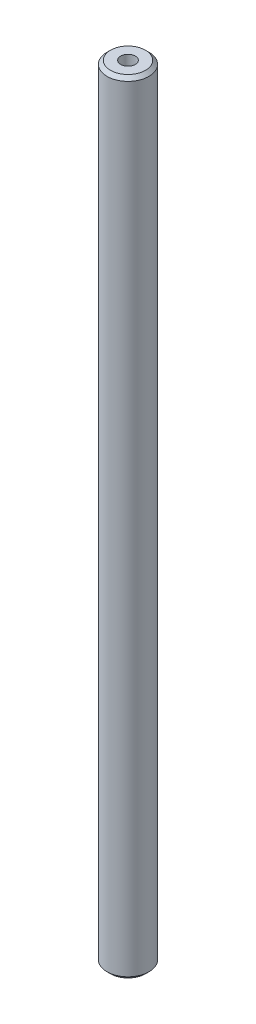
ISO-10303-21;
HEADER;
FILE_DESCRIPTION(('STEP AP214'),'2;1');
FILE_NAME('part.step','',(''),(''),'','','');
FILE_SCHEMA(('AUTOMOTIVE_DESIGN { 1 0 10303 214 1 1 1 1 }'));
ENDSEC;
DATA;
#1=APPLICATION_CONTEXT('core data for automotive mechanical design processes');
#2=APPLICATION_PROTOCOL_DEFINITION('international standard','automotive_design',2000,#1);
#3=PRODUCT_CONTEXT('',#1,'mechanical');
#4=PRODUCT('Part','Part','',(#3));
#5=PRODUCT_RELATED_PRODUCT_CATEGORY('part','',(#4));
#6=PRODUCT_DEFINITION_FORMATION('','',#4);
#7=PRODUCT_DEFINITION_CONTEXT('part definition',#1,'design');
#8=PRODUCT_DEFINITION('design','',#6,#7);
#9=PRODUCT_DEFINITION_SHAPE('','',#8);
#10=(LENGTH_UNIT() NAMED_UNIT(*) SI_UNIT(.MILLI.,.METRE.));
#11=(NAMED_UNIT(*) PLANE_ANGLE_UNIT() SI_UNIT($,.RADIAN.));
#12=(NAMED_UNIT(*) SI_UNIT($,.STERADIAN.) SOLID_ANGLE_UNIT());
#13=UNCERTAINTY_MEASURE_WITH_UNIT(LENGTH_MEASURE(1.E-05),#10,'distance_accuracy_value','');
#14=(GEOMETRIC_REPRESENTATION_CONTEXT(3) GLOBAL_UNCERTAINTY_ASSIGNED_CONTEXT((#13)) GLOBAL_UNIT_ASSIGNED_CONTEXT((#10,
#11,#12)) REPRESENTATION_CONTEXT('',''));
#15=CARTESIAN_POINT('',(0.,0.,0.));
#16=DIRECTION('',(0.,0.,1.));
#17=DIRECTION('',(1.,0.,0.));
#18=AXIS2_PLACEMENT_3D('',#15,#16,#17);
#19=CARTESIAN_POINT('',(0.,224.,0.));
#20=DIRECTION('',(0.,-1.,0.));
#21=DIRECTION('',(0.,0.,-1.));
#22=AXIS2_PLACEMENT_3D('',#19,#20,#21);
#23=CYLINDRICAL_SURFACE('',#22,6.);
#24=CARTESIAN_POINT('',(0.,1.,0.));
#25=DIRECTION('',(0.,1.,0.));
#26=DIRECTION('',(0.,0.,1.));
#27=AXIS2_PLACEMENT_3D('',#24,#25,#26);
#28=CIRCLE('',#27,6.);
#29=CARTESIAN_POINT('',(0.,1.,6.));
#30=VERTEX_POINT('',#29);
#31=EDGE_CURVE('E9210',#30,#30,#28,.T.);
#32=ORIENTED_EDGE('',*,*,#31,.T.);
#33=EDGE_LOOP('',(#32));
#34=FACE_BOUND('',#33,.T.);
#35=CARTESIAN_POINT('',(0.,223.,0.));
#36=DIRECTION('',(0.,1.,0.));
#37=DIRECTION('',(0.,0.,1.));
#38=AXIS2_PLACEMENT_3D('',#35,#36,#37);
#39=CIRCLE('',#38,6.);
#40=CARTESIAN_POINT('',(0.,223.,6.));
#41=VERTEX_POINT('',#40);
#42=EDGE_CURVE('E9207',#41,#41,#39,.F.);
#43=ORIENTED_EDGE('',*,*,#42,.T.);
#44=EDGE_LOOP('',(#43));
#45=FACE_BOUND('',#44,.T.);
#46=ADVANCED_FACE('F9174',(#34,#45),#23,.T.);
#47=CARTESIAN_POINT('',(0.,224.,0.));
#48=DIRECTION('',(0.,1.,0.));
#49=DIRECTION('',(0.,0.,1.));
#50=AXIS2_PLACEMENT_3D('',#47,#48,#49);
#51=PLANE('',#50);
#52=CARTESIAN_POINT('',(0.,224.,0.));
#53=DIRECTION('',(0.,1.,0.));
#54=DIRECTION('',(0.,0.,1.));
#55=AXIS2_PLACEMENT_3D('',#52,#53,#54);
#56=CIRCLE('',#55,2.09999999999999);
#57=CARTESIAN_POINT('',(0.,224.,2.09999999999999));
#58=VERTEX_POINT('',#57);
#59=EDGE_CURVE('E9204',#58,#58,#56,.T.);
#60=ORIENTED_EDGE('',*,*,#59,.F.);
#61=EDGE_LOOP('',(#60));
#62=FACE_BOUND('',#61,.T.);
#63=CARTESIAN_POINT('',(0.,224.,0.));
#64=DIRECTION('',(0.,1.,0.));
#65=DIRECTION('',(0.,0.,1.));
#66=AXIS2_PLACEMENT_3D('',#63,#64,#65);
#67=CIRCLE('',#66,5.);
#68=CARTESIAN_POINT('',(0.,224.,5.));
#69=VERTEX_POINT('',#68);
#70=EDGE_CURVE('E11',#69,#69,#67,.T.);
#71=ORIENTED_EDGE('',*,*,#70,.T.);
#72=EDGE_LOOP('',(#71));
#73=FACE_BOUND('',#72,.T.);
#74=ADVANCED_FACE('F9226',(#62,#73),#51,.T.);
#75=CARTESIAN_POINT('',(0.,0.,0.));
#76=DIRECTION('',(0.,1.,0.));
#77=DIRECTION('',(0.,0.,1.));
#78=AXIS2_PLACEMENT_3D('',#75,#76,#77);
#79=PLANE('',#78);
#80=CARTESIAN_POINT('',(0.,0.,0.));
#81=DIRECTION('',(0.,-1.,0.));
#82=DIRECTION('',(0.,0.,-1.));
#83=AXIS2_PLACEMENT_3D('',#80,#81,#82);
#84=CIRCLE('',#83,2.09999999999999);
#85=CARTESIAN_POINT('',(0.,0.,-2.09999999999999));
#86=VERTEX_POINT('',#85);
#87=EDGE_CURVE('E9196',#86,#86,#84,.T.);
#88=ORIENTED_EDGE('',*,*,#87,.F.);
#89=EDGE_LOOP('',(#88));
#90=FACE_BOUND('',#89,.T.);
#91=CARTESIAN_POINT('',(0.,0.,0.));
#92=DIRECTION('',(0.,1.,0.));
#93=DIRECTION('',(0.,0.,1.));
#94=AXIS2_PLACEMENT_3D('',#91,#92,#93);
#95=CIRCLE('',#94,5.00000000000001);
#96=CARTESIAN_POINT('',(0.,0.,5.00000000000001));
#97=VERTEX_POINT('',#96);
#98=EDGE_CURVE('E9181',#97,#97,#95,.F.);
#99=ORIENTED_EDGE('',*,*,#98,.T.);
#100=EDGE_LOOP('',(#99));
#101=FACE_BOUND('',#100,.T.);
#102=ADVANCED_FACE('F9215',(#90,#101),#79,.F.);
#103=CARTESIAN_POINT('',(0.,1.,0.));
#104=DIRECTION('',(0.,1.,0.));
#105=DIRECTION('',(0.,0.,1.));
#106=AXIS2_PLACEMENT_3D('',#103,#104,#105);
#107=CONICAL_SURFACE('',#106,6.,0.785398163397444);
#108=ORIENTED_EDGE('',*,*,#98,.F.);
#109=EDGE_LOOP('',(#108));
#110=FACE_BOUND('',#109,.T.);
#111=ORIENTED_EDGE('',*,*,#31,.F.);
#112=EDGE_LOOP('',(#111));
#113=FACE_BOUND('',#112,.T.);
#114=ADVANCED_FACE('F9217',(#110,#113),#107,.T.);
#115=CARTESIAN_POINT('',(0.,224.,0.));
#116=DIRECTION('',(0.,-1.,0.));
#117=DIRECTION('',(0.,0.,-1.));
#118=AXIS2_PLACEMENT_3D('',#115,#116,#117);
#119=CONICAL_SURFACE('',#118,5.,0.785398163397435);
#120=ORIENTED_EDGE('',*,*,#42,.F.);
#121=EDGE_LOOP('',(#120));
#122=FACE_BOUND('',#121,.T.);
#123=ORIENTED_EDGE('',*,*,#70,.F.);
#124=EDGE_LOOP('',(#123));
#125=FACE_BOUND('',#124,.T.);
#126=ADVANCED_FACE('F9220',(#122,#125),#119,.T.);
#127=CARTESIAN_POINT('',(0.,224.,0.));
#128=DIRECTION('',(0.,1.,0.));
#129=DIRECTION('',(0.,0.,1.));
#130=AXIS2_PLACEMENT_3D('',#127,#128,#129);
#131=CYLINDRICAL_SURFACE('',#130,2.09999999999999);
#132=CARTESIAN_POINT('',(0.,211.6,0.));
#133=DIRECTION('',(0.,1.,0.));
#134=DIRECTION('',(0.,0.,1.));
#135=AXIS2_PLACEMENT_3D('',#132,#133,#134);
#136=CIRCLE('',#135,2.09999999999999);
#137=CARTESIAN_POINT('',(0.,211.6,2.09999999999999));
#138=VERTEX_POINT('',#137);
#139=EDGE_CURVE('E9199',#138,#138,#136,.T.);
#140=ORIENTED_EDGE('',*,*,#139,.F.);
#141=EDGE_LOOP('',(#140));
#142=FACE_BOUND('',#141,.T.);
#143=ORIENTED_EDGE('',*,*,#59,.T.);
#144=EDGE_LOOP('',(#143));
#145=FACE_BOUND('',#144,.T.);
#146=ADVANCED_FACE('F9231',(#142,#145),#131,.F.);
#147=CARTESIAN_POINT('',(0.,211.6,0.));
#148=DIRECTION('',(0.,1.,0.));
#149=DIRECTION('',(0.,0.,1.));
#150=AXIS2_PLACEMENT_3D('',#147,#148,#149);
#151=CONICAL_SURFACE('',#150,2.09999999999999,1.02974425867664);
#152=CARTESIAN_POINT('',(0.,210.338192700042,0.));
#153=VERTEX_POINT('',#152);
#154=VERTEX_LOOP('',#153);
#155=FACE_BOUND('',#154,.T.);
#156=ORIENTED_EDGE('',*,*,#139,.T.);
#157=EDGE_LOOP('',(#156));
#158=FACE_BOUND('',#157,.T.);
#159=ADVANCED_FACE('F9247',(#155,#158),#151,.F.);
#160=CARTESIAN_POINT('',(0.,0.,0.));
#161=DIRECTION('',(0.,-1.,0.));
#162=DIRECTION('',(0.,0.,-1.));
#163=AXIS2_PLACEMENT_3D('',#160,#161,#162);
#164=CYLINDRICAL_SURFACE('',#163,2.09999999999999);
#165=CARTESIAN_POINT('',(0.,12.4,0.));
#166=DIRECTION('',(0.,-1.,0.));
#167=DIRECTION('',(0.,0.,-1.));
#168=AXIS2_PLACEMENT_3D('',#165,#166,#167);
#169=CIRCLE('',#168,2.09999999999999);
#170=CARTESIAN_POINT('',(0.,12.4,-2.09999999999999));
#171=VERTEX_POINT('',#170);
#172=EDGE_CURVE('E9194',#171,#171,#169,.T.);
#173=ORIENTED_EDGE('',*,*,#172,.F.);
#174=EDGE_LOOP('',(#173));
#175=FACE_BOUND('',#174,.T.);
#176=ORIENTED_EDGE('',*,*,#87,.T.);
#177=EDGE_LOOP('',(#176));
#178=FACE_BOUND('',#177,.T.);
#179=ADVANCED_FACE('F9190',(#175,#178),#164,.F.);
#180=CARTESIAN_POINT('',(0.,12.4,0.));
#181=DIRECTION('',(0.,-1.,0.));
#182=DIRECTION('',(0.,0.,-1.));
#183=AXIS2_PLACEMENT_3D('',#180,#181,#182);
#184=CONICAL_SURFACE('',#183,2.09999999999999,1.02974425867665);
#185=CARTESIAN_POINT('',(0.,13.6618072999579,0.));
#186=VERTEX_POINT('',#185);
#187=VERTEX_LOOP('',#186);
#188=FACE_BOUND('',#187,.T.);
#189=ORIENTED_EDGE('',*,*,#172,.T.);
#190=EDGE_LOOP('',(#189));
#191=FACE_BOUND('',#190,.T.);
#192=ADVANCED_FACE('F9187',(#188,#191),#184,.F.);
#193=CLOSED_SHELL('',(#46,#74,#102,#114,#126,#146,#159,#179,#192));
#194=MANIFOLD_SOLID_BREP('B2',#193);
#195=ADVANCED_BREP_SHAPE_REPRESENTATION('',(#18,#194),#14);
#196=SHAPE_DEFINITION_REPRESENTATION(#9,#195);
ENDSEC;
END-ISO-10303-21;
